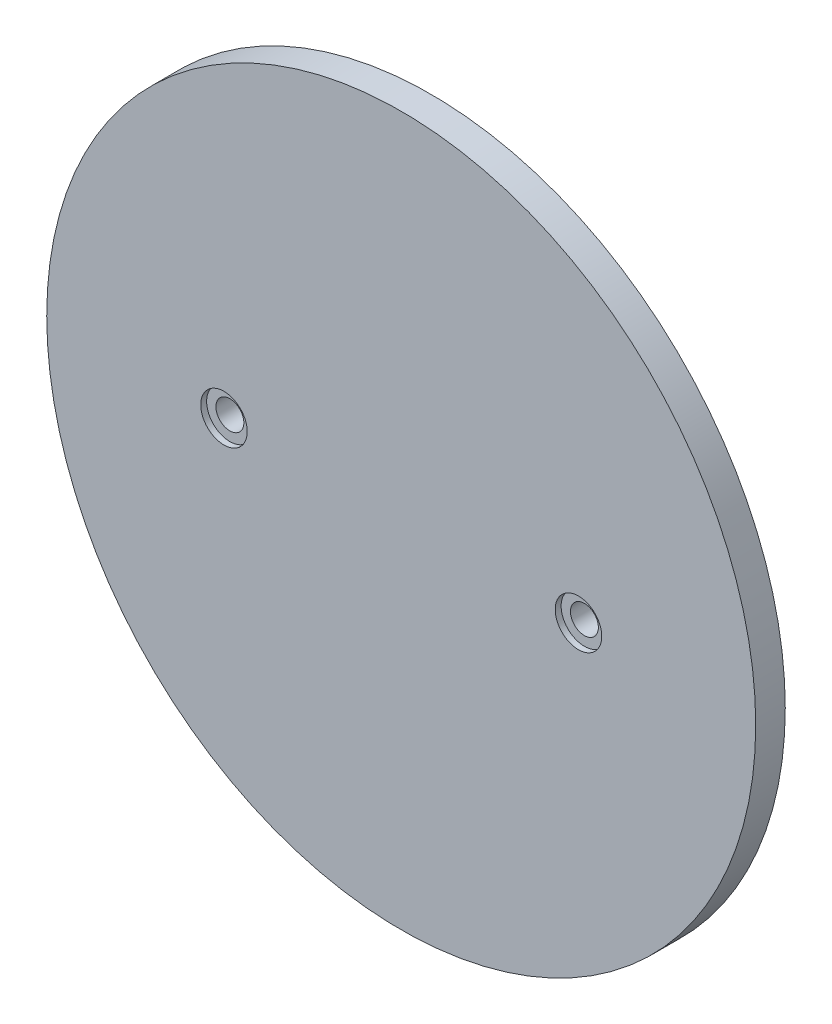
from build123d import *

# Parameters (mm, degrees)
SKETCH1_R           = 38.1
SKETCH1_R_2         = 1.5
BOSS_EXTRUDE1_DEPTH = 3.175
SKETCH2_R           = 2.5
CUT_EXTRUDE1_DEPTH  = 0.635


with BuildPart() as part:
    # Sketch1 → Boss-Extrude1 (new body)
    with BuildSketch(Plane(origin=(0, 0, 0), x_dir=(0, 1, 0), z_dir=(0, 0, 1))):
        with Locations(Location((0, 0, 0), (0, 0, 270))):
            Circle(SKETCH1_R)
        with Locations(Location((0, 19.05, 0), (0, 0, 270))):
            Circle(SKETCH1_R_2, mode=Mode.SUBTRACT)
        with Locations(Location((0, -19.05, 0), (0, 0, 90))):
            Circle(SKETCH1_R_2, mode=Mode.SUBTRACT)
    extrude(amount=BOSS_EXTRUDE1_DEPTH)

    # Sketch2 → Cut-Extrude1 (cut)
    with BuildSketch(Plane.XY.offset(3.175)):
        with Locations((-19.05, 0)):
            Circle(SKETCH2_R)
        with Locations((19.05, 0)):
            Circle(SKETCH2_R)
    extrude(amount=-CUT_EXTRUDE1_DEPTH, mode=Mode.SUBTRACT)


solid = part.part
